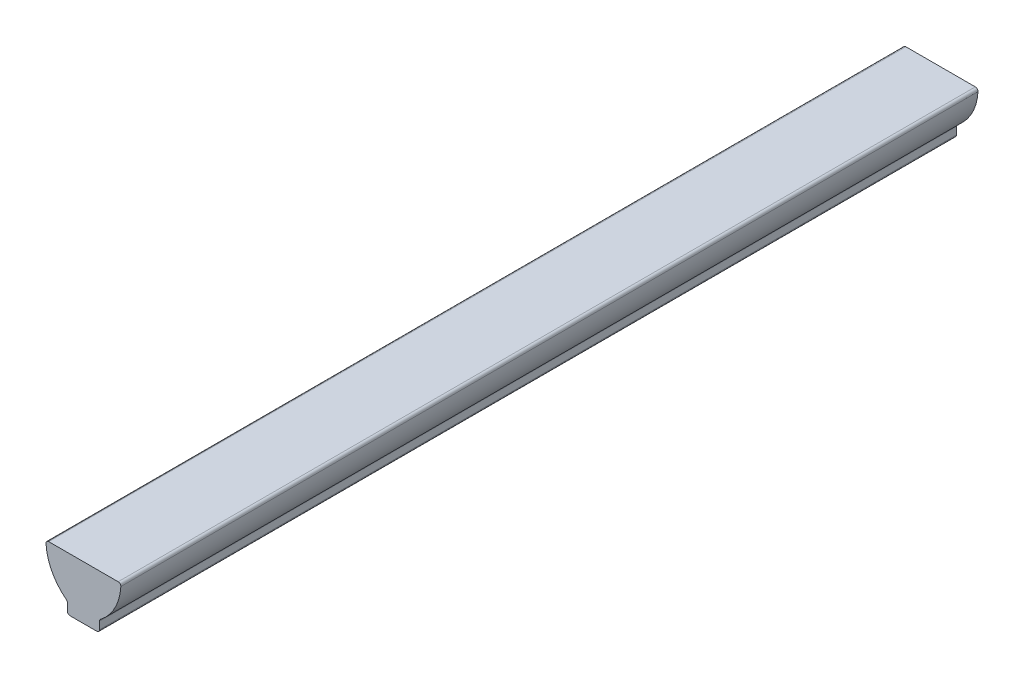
ISO-10303-21;
HEADER;
FILE_DESCRIPTION(('STEP AP214'),'2;1');
FILE_NAME('part.step','',(''),(''),'','','');
FILE_SCHEMA(('AUTOMOTIVE_DESIGN { 1 0 10303 214 1 1 1 1 }'));
ENDSEC;
DATA;
#1=APPLICATION_CONTEXT('core data for automotive mechanical design processes');
#2=APPLICATION_PROTOCOL_DEFINITION('international standard','automotive_design',2000,#1);
#3=PRODUCT_CONTEXT('',#1,'mechanical');
#4=PRODUCT('Part','Part','',(#3));
#5=PRODUCT_RELATED_PRODUCT_CATEGORY('part','',(#4));
#6=PRODUCT_DEFINITION_FORMATION('','',#4);
#7=PRODUCT_DEFINITION_CONTEXT('part definition',#1,'design');
#8=PRODUCT_DEFINITION('design','',#6,#7);
#9=PRODUCT_DEFINITION_SHAPE('','',#8);
#10=(LENGTH_UNIT() NAMED_UNIT(*) SI_UNIT(.MILLI.,.METRE.));
#11=(NAMED_UNIT(*) PLANE_ANGLE_UNIT() SI_UNIT($,.RADIAN.));
#12=(NAMED_UNIT(*) SI_UNIT($,.STERADIAN.) SOLID_ANGLE_UNIT());
#13=UNCERTAINTY_MEASURE_WITH_UNIT(LENGTH_MEASURE(1.E-05),#10,'distance_accuracy_value','');
#14=(GEOMETRIC_REPRESENTATION_CONTEXT(3) GLOBAL_UNCERTAINTY_ASSIGNED_CONTEXT((#13)) GLOBAL_UNIT_ASSIGNED_CONTEXT((#10,
#11,#12)) REPRESENTATION_CONTEXT('',''));
#15=CARTESIAN_POINT('',(0.,0.,0.));
#16=DIRECTION('',(0.,0.,1.));
#17=DIRECTION('',(1.,0.,0.));
#18=AXIS2_PLACEMENT_3D('',#15,#16,#17);
#19=CARTESIAN_POINT('',(-20.5944714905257,30.1625,508.));
#20=DIRECTION('',(0.,0.,-1.));
#21=DIRECTION('',(-1.,0.,0.));
#22=AXIS2_PLACEMENT_3D('',#19,#20,#21);
#23=CYLINDRICAL_SURFACE('',#22,1.5875);
#24=CARTESIAN_POINT('',(-20.5944714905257,30.1625,0.));
#25=DIRECTION('',(0.,0.,1.));
#26=DIRECTION('',(-1.,0.,0.));
#27=AXIS2_PLACEMENT_3D('',#24,#25,#26);
#28=CIRCLE('',#27,1.5875);
#29=CARTESIAN_POINT('',(-20.5944714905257,31.75,0.));
#30=VERTEX_POINT('',#29);
#31=CARTESIAN_POINT('',(-22.1796406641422,30.076506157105,0.));
#32=VERTEX_POINT('',#31);
#33=EDGE_CURVE('E106',#30,#32,#28,.T.);
#34=ORIENTED_EDGE('',*,*,#33,.T.);
#35=DIRECTION('',(0.,0.,-1.));
#36=VECTOR('',#35,1.);
#37=CARTESIAN_POINT('',(-22.1796406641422,30.076506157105,508.));
#38=LINE('',#37,#36);
#39=CARTESIAN_POINT('',(-22.1796406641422,30.076506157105,508.));
#40=VERTEX_POINT('',#39);
#41=EDGE_CURVE('E9',#40,#32,#38,.T.);
#42=ORIENTED_EDGE('',*,*,#41,.F.);
#43=CARTESIAN_POINT('',(-20.5944714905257,30.1625,508.));
#44=DIRECTION('',(0.,0.,1.));
#45=DIRECTION('',(-1.,0.,0.));
#46=AXIS2_PLACEMENT_3D('',#43,#44,#45);
#47=CIRCLE('',#46,1.5875);
#48=CARTESIAN_POINT('',(-20.5944714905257,31.75,508.));
#49=VERTEX_POINT('',#48);
#50=EDGE_CURVE('E141',#49,#40,#47,.T.);
#51=ORIENTED_EDGE('',*,*,#50,.F.);
#52=DIRECTION('',(0.,0.,-1.));
#53=VECTOR('',#52,1.);
#54=CARTESIAN_POINT('',(-20.5944714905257,31.75,508.));
#55=LINE('',#54,#53);
#56=EDGE_CURVE('E119',#49,#30,#55,.T.);
#57=ORIENTED_EDGE('',*,*,#56,.T.);
#58=EDGE_LOOP('',(#34,#42,#51,#57));
#59=FACE_BOUND('',#58,.T.);
#60=ADVANCED_FACE('F14',(#59),#23,.T.);
#61=CARTESIAN_POINT('',(8.66874060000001,31.75,508.));
#62=DIRECTION('',(0.,0.,-1.));
#63=DIRECTION('',(-1.,0.,0.));
#64=AXIS2_PLACEMENT_3D('',#61,#62,#63);
#65=CYLINDRICAL_SURFACE('',#64,30.8937406);
#66=CARTESIAN_POINT('',(8.66874060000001,31.75,0.));
#67=DIRECTION('',(0.,0.,1.));
#68=DIRECTION('',(1.,0.,0.));
#69=AXIS2_PLACEMENT_3D('',#66,#67,#68);
#70=CIRCLE('',#69,30.8937406);
#71=CARTESIAN_POINT('',(-10.1457044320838,7.24612548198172,0.));
#72=VERTEX_POINT('',#71);
#73=EDGE_CURVE('E102',#32,#72,#70,.T.);
#74=ORIENTED_EDGE('',*,*,#73,.T.);
#75=DIRECTION('',(0.,0.,-1.));
#76=VECTOR('',#75,1.);
#77=CARTESIAN_POINT('',(-10.1457044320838,7.24612548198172,508.));
#78=LINE('',#77,#76);
#79=CARTESIAN_POINT('',(-10.1457044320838,7.24612548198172,508.));
#80=VERTEX_POINT('',#79);
#81=EDGE_CURVE('E21',#80,#72,#78,.T.);
#82=ORIENTED_EDGE('',*,*,#81,.F.);
#83=CARTESIAN_POINT('',(8.66874060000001,31.75,508.));
#84=DIRECTION('',(0.,0.,1.));
#85=DIRECTION('',(1.,0.,0.));
#86=AXIS2_PLACEMENT_3D('',#83,#84,#85);
#87=CIRCLE('',#86,30.8937406);
#88=EDGE_CURVE('E115',#40,#80,#87,.T.);
#89=ORIENTED_EDGE('',*,*,#88,.F.);
#90=ORIENTED_EDGE('',*,*,#41,.T.);
#91=EDGE_LOOP('',(#74,#82,#89,#90));
#92=FACE_BOUND('',#91,.T.);
#93=ADVANCED_FACE('F114',(#92),#65,.T.);
#94=CARTESIAN_POINT('',(-11.1125,5.98697395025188,508.));
#95=DIRECTION('',(0.,0.,-1.));
#96=DIRECTION('',(-1.,0.,0.));
#97=AXIS2_PLACEMENT_3D('',#94,#95,#96);
#98=CYLINDRICAL_SURFACE('',#97,1.5875);
#99=CARTESIAN_POINT('',(-11.1125,5.98697395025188,0.));
#100=DIRECTION('',(0.,0.,-1.));
#101=DIRECTION('',(-1.,0.,0.));
#102=AXIS2_PLACEMENT_3D('',#99,#100,#101);
#103=CIRCLE('',#102,1.5875);
#104=CARTESIAN_POINT('',(-9.525,5.98697395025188,0.));
#105=VERTEX_POINT('',#104);
#106=EDGE_CURVE('E108',#72,#105,#103,.T.);
#107=ORIENTED_EDGE('',*,*,#106,.T.);
#108=DIRECTION('',(0.,0.,-1.));
#109=VECTOR('',#108,1.);
#110=CARTESIAN_POINT('',(-9.525,5.98697395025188,508.));
#111=LINE('',#110,#109);
#112=CARTESIAN_POINT('',(-9.525,5.98697395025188,508.));
#113=VERTEX_POINT('',#112);
#114=EDGE_CURVE('E187',#113,#105,#111,.T.);
#115=ORIENTED_EDGE('',*,*,#114,.F.);
#116=CARTESIAN_POINT('',(-11.1125,5.98697395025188,508.));
#117=DIRECTION('',(0.,0.,-1.));
#118=DIRECTION('',(-1.,0.,0.));
#119=AXIS2_PLACEMENT_3D('',#116,#117,#118);
#120=CIRCLE('',#119,1.5875);
#121=EDGE_CURVE('E144',#80,#113,#120,.T.);
#122=ORIENTED_EDGE('',*,*,#121,.F.);
#123=ORIENTED_EDGE('',*,*,#81,.T.);
#124=EDGE_LOOP('',(#107,#115,#122,#123));
#125=FACE_BOUND('',#124,.T.);
#126=ADVANCED_FACE('F191',(#125),#98,.F.);
#127=CARTESIAN_POINT('',(-9.525,1.5875,508.));
#128=DIRECTION('',(1.,0.,0.));
#129=DIRECTION('',(0.,0.,-1.));
#130=AXIS2_PLACEMENT_3D('',#127,#128,#129);
#131=PLANE('',#130);
#132=DIRECTION('',(0.,-1.,0.));
#133=VECTOR('',#132,1.);
#134=CARTESIAN_POINT('',(-9.525,1.5875,0.));
#135=LINE('',#134,#133);
#136=CARTESIAN_POINT('',(-9.525,1.5875,0.));
#137=VERTEX_POINT('',#136);
#138=EDGE_CURVE('E123',#105,#137,#135,.T.);
#139=ORIENTED_EDGE('',*,*,#138,.T.);
#140=DIRECTION('',(0.,0.,-1.));
#141=VECTOR('',#140,1.);
#142=CARTESIAN_POINT('',(-9.525,1.5875,508.));
#143=LINE('',#142,#141);
#144=CARTESIAN_POINT('',(-9.525,1.5875,508.));
#145=VERTEX_POINT('',#144);
#146=EDGE_CURVE('E184',#145,#137,#143,.T.);
#147=ORIENTED_EDGE('',*,*,#146,.F.);
#148=DIRECTION('',(0.,-1.,0.));
#149=VECTOR('',#148,1.);
#150=CARTESIAN_POINT('',(-9.525,1.5875,508.));
#151=LINE('',#150,#149);
#152=EDGE_CURVE('E146',#113,#145,#151,.T.);
#153=ORIENTED_EDGE('',*,*,#152,.F.);
#154=ORIENTED_EDGE('',*,*,#114,.T.);
#155=EDGE_LOOP('',(#139,#147,#153,#154));
#156=FACE_BOUND('',#155,.T.);
#157=ADVANCED_FACE('F199',(#156),#131,.F.);
#158=CARTESIAN_POINT('',(-7.9375,1.5875,508.));
#159=DIRECTION('',(0.,0.,-1.));
#160=DIRECTION('',(-1.,0.,0.));
#161=AXIS2_PLACEMENT_3D('',#158,#159,#160);
#162=CYLINDRICAL_SURFACE('',#161,1.5875);
#163=CARTESIAN_POINT('',(-7.9375,1.5875,0.));
#164=DIRECTION('',(0.,0.,1.));
#165=DIRECTION('',(1.,0.,0.));
#166=AXIS2_PLACEMENT_3D('',#163,#164,#165);
#167=CIRCLE('',#166,1.5875);
#168=CARTESIAN_POINT('',(-7.9375,0.,0.));
#169=VERTEX_POINT('',#168);
#170=EDGE_CURVE('E125',#137,#169,#167,.T.);
#171=ORIENTED_EDGE('',*,*,#170,.T.);
#172=DIRECTION('',(0.,0.,-1.));
#173=VECTOR('',#172,1.);
#174=CARTESIAN_POINT('',(-7.9375,0.,508.));
#175=LINE('',#174,#173);
#176=CARTESIAN_POINT('',(-7.9375,0.,508.));
#177=VERTEX_POINT('',#176);
#178=EDGE_CURVE('E181',#177,#169,#175,.T.);
#179=ORIENTED_EDGE('',*,*,#178,.F.);
#180=CARTESIAN_POINT('',(-7.9375,1.5875,508.));
#181=DIRECTION('',(0.,0.,1.));
#182=DIRECTION('',(1.,0.,0.));
#183=AXIS2_PLACEMENT_3D('',#180,#181,#182);
#184=CIRCLE('',#183,1.5875);
#185=EDGE_CURVE('E148',#145,#177,#184,.T.);
#186=ORIENTED_EDGE('',*,*,#185,.F.);
#187=ORIENTED_EDGE('',*,*,#146,.T.);
#188=EDGE_LOOP('',(#171,#179,#186,#187));
#189=FACE_BOUND('',#188,.T.);
#190=ADVANCED_FACE('F202',(#189),#162,.T.);
#191=CARTESIAN_POINT('',(-7.9375,0.,508.));
#192=DIRECTION('',(0.,1.,0.));
#193=DIRECTION('',(0.,0.,1.));
#194=AXIS2_PLACEMENT_3D('',#191,#192,#193);
#195=PLANE('',#194);
#196=DIRECTION('',(1.,0.,0.));
#197=VECTOR('',#196,1.);
#198=CARTESIAN_POINT('',(-7.9375,0.,0.));
#199=LINE('',#198,#197);
#200=CARTESIAN_POINT('',(7.9375,0.,0.));
#201=VERTEX_POINT('',#200);
#202=EDGE_CURVE('E127',#169,#201,#199,.T.);
#203=ORIENTED_EDGE('',*,*,#202,.T.);
#204=DIRECTION('',(0.,0.,-1.));
#205=VECTOR('',#204,1.);
#206=CARTESIAN_POINT('',(7.9375,0.,508.));
#207=LINE('',#206,#205);
#208=CARTESIAN_POINT('',(7.9375,0.,508.));
#209=VERTEX_POINT('',#208);
#210=EDGE_CURVE('E178',#209,#201,#207,.T.);
#211=ORIENTED_EDGE('',*,*,#210,.F.);
#212=DIRECTION('',(1.,0.,0.));
#213=VECTOR('',#212,1.);
#214=CARTESIAN_POINT('',(-7.9375,0.,508.));
#215=LINE('',#214,#213);
#216=EDGE_CURVE('E150',#177,#209,#215,.T.);
#217=ORIENTED_EDGE('',*,*,#216,.F.);
#218=ORIENTED_EDGE('',*,*,#178,.T.);
#219=EDGE_LOOP('',(#203,#211,#217,#218));
#220=FACE_BOUND('',#219,.T.);
#221=ADVANCED_FACE('F207',(#220),#195,.F.);
#222=CARTESIAN_POINT('',(7.9375,1.5875,508.));
#223=DIRECTION('',(0.,0.,-1.));
#224=DIRECTION('',(-1.,0.,0.));
#225=AXIS2_PLACEMENT_3D('',#222,#223,#224);
#226=CYLINDRICAL_SURFACE('',#225,1.5875);
#227=CARTESIAN_POINT('',(7.9375,1.5875,0.));
#228=DIRECTION('',(0.,0.,1.));
#229=DIRECTION('',(1.,0.,0.));
#230=AXIS2_PLACEMENT_3D('',#227,#228,#229);
#231=CIRCLE('',#230,1.5875);
#232=CARTESIAN_POINT('',(9.525,1.5875,0.));
#233=VERTEX_POINT('',#232);
#234=EDGE_CURVE('E129',#201,#233,#231,.T.);
#235=ORIENTED_EDGE('',*,*,#234,.T.);
#236=DIRECTION('',(0.,0.,-1.));
#237=VECTOR('',#236,1.);
#238=CARTESIAN_POINT('',(9.525,1.5875,508.));
#239=LINE('',#238,#237);
#240=CARTESIAN_POINT('',(9.525,1.5875,508.));
#241=VERTEX_POINT('',#240);
#242=EDGE_CURVE('E175',#241,#233,#239,.T.);
#243=ORIENTED_EDGE('',*,*,#242,.F.);
#244=CARTESIAN_POINT('',(7.9375,1.5875,508.));
#245=DIRECTION('',(0.,0.,1.));
#246=DIRECTION('',(1.,0.,0.));
#247=AXIS2_PLACEMENT_3D('',#244,#245,#246);
#248=CIRCLE('',#247,1.5875);
#249=EDGE_CURVE('E152',#209,#241,#248,.T.);
#250=ORIENTED_EDGE('',*,*,#249,.F.);
#251=ORIENTED_EDGE('',*,*,#210,.T.);
#252=EDGE_LOOP('',(#235,#243,#250,#251));
#253=FACE_BOUND('',#252,.T.);
#254=ADVANCED_FACE('F213',(#253),#226,.T.);
#255=CARTESIAN_POINT('',(9.525,1.5875,508.));
#256=DIRECTION('',(-1.,0.,0.));
#257=DIRECTION('',(0.,0.,1.));
#258=AXIS2_PLACEMENT_3D('',#255,#256,#257);
#259=PLANE('',#258);
#260=DIRECTION('',(0.,1.,0.));
#261=VECTOR('',#260,1.);
#262=CARTESIAN_POINT('',(9.525,1.5875,0.));
#263=LINE('',#262,#261);
#264=CARTESIAN_POINT('',(9.525,5.98697395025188,0.));
#265=VERTEX_POINT('',#264);
#266=EDGE_CURVE('E131',#233,#265,#263,.T.);
#267=ORIENTED_EDGE('',*,*,#266,.T.);
#268=DIRECTION('',(0.,0.,-1.));
#269=VECTOR('',#268,1.);
#270=CARTESIAN_POINT('',(9.525,5.98697395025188,508.));
#271=LINE('',#270,#269);
#272=CARTESIAN_POINT('',(9.525,5.98697395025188,508.));
#273=VERTEX_POINT('',#272);
#274=EDGE_CURVE('E172',#273,#265,#271,.T.);
#275=ORIENTED_EDGE('',*,*,#274,.F.);
#276=DIRECTION('',(0.,1.,0.));
#277=VECTOR('',#276,1.);
#278=CARTESIAN_POINT('',(9.525,1.5875,508.));
#279=LINE('',#278,#277);
#280=EDGE_CURVE('E154',#241,#273,#279,.T.);
#281=ORIENTED_EDGE('',*,*,#280,.F.);
#282=ORIENTED_EDGE('',*,*,#242,.T.);
#283=EDGE_LOOP('',(#267,#275,#281,#282));
#284=FACE_BOUND('',#283,.T.);
#285=ADVANCED_FACE('F217',(#284),#259,.F.);
#286=CARTESIAN_POINT('',(11.1125,5.98697395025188,508.));
#287=DIRECTION('',(0.,0.,-1.));
#288=DIRECTION('',(-1.,0.,0.));
#289=AXIS2_PLACEMENT_3D('',#286,#287,#288);
#290=CYLINDRICAL_SURFACE('',#289,1.5875);
#291=CARTESIAN_POINT('',(11.1125,5.98697395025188,0.));
#292=DIRECTION('',(0.,0.,-1.));
#293=DIRECTION('',(-1.,0.,0.));
#294=AXIS2_PLACEMENT_3D('',#291,#292,#293);
#295=CIRCLE('',#294,1.5875);
#296=CARTESIAN_POINT('',(10.1457044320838,7.24612548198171,0.));
#297=VERTEX_POINT('',#296);
#298=EDGE_CURVE('E133',#265,#297,#295,.T.);
#299=ORIENTED_EDGE('',*,*,#298,.T.);
#300=DIRECTION('',(0.,0.,-1.));
#301=VECTOR('',#300,1.);
#302=CARTESIAN_POINT('',(10.1457044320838,7.24612548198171,508.));
#303=LINE('',#302,#301);
#304=CARTESIAN_POINT('',(10.1457044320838,7.24612548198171,508.));
#305=VERTEX_POINT('',#304);
#306=EDGE_CURVE('E169',#305,#297,#303,.T.);
#307=ORIENTED_EDGE('',*,*,#306,.F.);
#308=CARTESIAN_POINT('',(11.1125,5.98697395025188,508.));
#309=DIRECTION('',(0.,0.,-1.));
#310=DIRECTION('',(-1.,0.,0.));
#311=AXIS2_PLACEMENT_3D('',#308,#309,#310);
#312=CIRCLE('',#311,1.5875);
#313=EDGE_CURVE('E156',#273,#305,#312,.T.);
#314=ORIENTED_EDGE('',*,*,#313,.F.);
#315=ORIENTED_EDGE('',*,*,#274,.T.);
#316=EDGE_LOOP('',(#299,#307,#314,#315));
#317=FACE_BOUND('',#316,.T.);
#318=ADVANCED_FACE('F222',(#317),#290,.F.);
#319=CARTESIAN_POINT('',(-8.66874060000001,31.75,508.));
#320=DIRECTION('',(0.,0.,-1.));
#321=DIRECTION('',(-1.,0.,0.));
#322=AXIS2_PLACEMENT_3D('',#319,#320,#321);
#323=CYLINDRICAL_SURFACE('',#322,30.8937406);
#324=CARTESIAN_POINT('',(-8.66874060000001,31.75,0.));
#325=DIRECTION('',(0.,0.,1.));
#326=DIRECTION('',(-1.,0.,0.));
#327=AXIS2_PLACEMENT_3D('',#324,#325,#326);
#328=CIRCLE('',#327,30.8937406);
#329=CARTESIAN_POINT('',(22.1796406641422,30.076506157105,0.));
#330=VERTEX_POINT('',#329);
#331=EDGE_CURVE('E135',#297,#330,#328,.T.);
#332=ORIENTED_EDGE('',*,*,#331,.T.);
#333=DIRECTION('',(0.,0.,-1.));
#334=VECTOR('',#333,1.);
#335=CARTESIAN_POINT('',(22.1796406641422,30.076506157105,508.));
#336=LINE('',#335,#334);
#337=CARTESIAN_POINT('',(22.1796406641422,30.076506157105,508.));
#338=VERTEX_POINT('',#337);
#339=EDGE_CURVE('E166',#338,#330,#336,.T.);
#340=ORIENTED_EDGE('',*,*,#339,.F.);
#341=CARTESIAN_POINT('',(-8.66874060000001,31.75,508.));
#342=DIRECTION('',(0.,0.,1.));
#343=DIRECTION('',(-1.,0.,0.));
#344=AXIS2_PLACEMENT_3D('',#341,#342,#343);
#345=CIRCLE('',#344,30.8937406);
#346=EDGE_CURVE('E158',#305,#338,#345,.T.);
#347=ORIENTED_EDGE('',*,*,#346,.F.);
#348=ORIENTED_EDGE('',*,*,#306,.T.);
#349=EDGE_LOOP('',(#332,#340,#347,#348));
#350=FACE_BOUND('',#349,.T.);
#351=ADVANCED_FACE('F226',(#350),#323,.T.);
#352=CARTESIAN_POINT('',(20.5944714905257,30.1625,508.));
#353=DIRECTION('',(0.,0.,-1.));
#354=DIRECTION('',(-1.,0.,0.));
#355=AXIS2_PLACEMENT_3D('',#352,#353,#354);
#356=CYLINDRICAL_SURFACE('',#355,1.5875);
#357=CARTESIAN_POINT('',(20.5944714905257,30.1625,0.));
#358=DIRECTION('',(0.,0.,1.));
#359=DIRECTION('',(-1.,0.,0.));
#360=AXIS2_PLACEMENT_3D('',#357,#358,#359);
#361=CIRCLE('',#360,1.5875);
#362=CARTESIAN_POINT('',(20.5944714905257,31.75,0.));
#363=VERTEX_POINT('',#362);
#364=EDGE_CURVE('E137',#330,#363,#361,.T.);
#365=ORIENTED_EDGE('',*,*,#364,.T.);
#366=DIRECTION('',(0.,0.,-1.));
#367=VECTOR('',#366,1.);
#368=CARTESIAN_POINT('',(20.5944714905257,31.75,508.));
#369=LINE('',#368,#367);
#370=CARTESIAN_POINT('',(20.5944714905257,31.75,508.));
#371=VERTEX_POINT('',#370);
#372=EDGE_CURVE('E163',#371,#363,#369,.T.);
#373=ORIENTED_EDGE('',*,*,#372,.F.);
#374=CARTESIAN_POINT('',(20.5944714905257,30.1625,508.));
#375=DIRECTION('',(0.,0.,1.));
#376=DIRECTION('',(-1.,0.,0.));
#377=AXIS2_PLACEMENT_3D('',#374,#375,#376);
#378=CIRCLE('',#377,1.5875);
#379=EDGE_CURVE('E33',#338,#371,#378,.T.);
#380=ORIENTED_EDGE('',*,*,#379,.F.);
#381=ORIENTED_EDGE('',*,*,#339,.T.);
#382=EDGE_LOOP('',(#365,#373,#380,#381));
#383=FACE_BOUND('',#382,.T.);
#384=ADVANCED_FACE('F230',(#383),#356,.T.);
#385=CARTESIAN_POINT('',(-20.5944714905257,31.75,508.));
#386=DIRECTION('',(0.,-1.,0.));
#387=DIRECTION('',(0.,0.,-1.));
#388=AXIS2_PLACEMENT_3D('',#385,#386,#387);
#389=PLANE('',#388);
#390=DIRECTION('',(-1.,0.,0.));
#391=VECTOR('',#390,1.);
#392=CARTESIAN_POINT('',(-20.5944714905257,31.75,0.));
#393=LINE('',#392,#391);
#394=EDGE_CURVE('E139',#363,#30,#393,.T.);
#395=ORIENTED_EDGE('',*,*,#394,.T.);
#396=ORIENTED_EDGE('',*,*,#56,.F.);
#397=DIRECTION('',(-1.,0.,0.));
#398=VECTOR('',#397,1.);
#399=CARTESIAN_POINT('',(-20.5944714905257,31.75,508.));
#400=LINE('',#399,#398);
#401=EDGE_CURVE('E28',#371,#49,#400,.T.);
#402=ORIENTED_EDGE('',*,*,#401,.F.);
#403=ORIENTED_EDGE('',*,*,#372,.T.);
#404=EDGE_LOOP('',(#395,#396,#402,#403));
#405=FACE_BOUND('',#404,.T.);
#406=ADVANCED_FACE('F232',(#405),#389,.F.);
#407=CARTESIAN_POINT('',(-20.5944714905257,30.1625,508.));
#408=DIRECTION('',(0.,0.,-1.));
#409=DIRECTION('',(-1.,0.,0.));
#410=AXIS2_PLACEMENT_3D('',#407,#408,#409);
#411=PLANE('',#410);
#412=ORIENTED_EDGE('',*,*,#50,.T.);
#413=ORIENTED_EDGE('',*,*,#88,.T.);
#414=ORIENTED_EDGE('',*,*,#121,.T.);
#415=ORIENTED_EDGE('',*,*,#152,.T.);
#416=ORIENTED_EDGE('',*,*,#185,.T.);
#417=ORIENTED_EDGE('',*,*,#216,.T.);
#418=ORIENTED_EDGE('',*,*,#249,.T.);
#419=ORIENTED_EDGE('',*,*,#280,.T.);
#420=ORIENTED_EDGE('',*,*,#313,.T.);
#421=ORIENTED_EDGE('',*,*,#346,.T.);
#422=ORIENTED_EDGE('',*,*,#379,.T.);
#423=ORIENTED_EDGE('',*,*,#401,.T.);
#424=EDGE_LOOP('',(#412,#413,#414,#415,#416,#417,#418,#419,#420,#421,#422,#423));
#425=FACE_BOUND('',#424,.T.);
#426=ADVANCED_FACE('F194',(#425),#411,.F.);
#427=CARTESIAN_POINT('',(-20.5944714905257,30.1625,0.));
#428=DIRECTION('',(0.,0.,-1.));
#429=DIRECTION('',(-1.,0.,0.));
#430=AXIS2_PLACEMENT_3D('',#427,#428,#429);
#431=PLANE('',#430);
#432=ORIENTED_EDGE('',*,*,#33,.F.);
#433=ORIENTED_EDGE('',*,*,#394,.F.);
#434=ORIENTED_EDGE('',*,*,#364,.F.);
#435=ORIENTED_EDGE('',*,*,#331,.F.);
#436=ORIENTED_EDGE('',*,*,#298,.F.);
#437=ORIENTED_EDGE('',*,*,#266,.F.);
#438=ORIENTED_EDGE('',*,*,#234,.F.);
#439=ORIENTED_EDGE('',*,*,#202,.F.);
#440=ORIENTED_EDGE('',*,*,#170,.F.);
#441=ORIENTED_EDGE('',*,*,#138,.F.);
#442=ORIENTED_EDGE('',*,*,#106,.F.);
#443=ORIENTED_EDGE('',*,*,#73,.F.);
#444=EDGE_LOOP('',(#432,#433,#434,#435,#436,#437,#438,#439,#440,#441,#442,#443));
#445=FACE_BOUND('',#444,.T.);
#446=ADVANCED_FACE('F103',(#445),#431,.T.);
#447=CLOSED_SHELL('',(#60,#93,#126,#157,#190,#221,#254,#285,#318,#351,#384,#406,#426,#446));
#448=MANIFOLD_SOLID_BREP('B1',#447);
#449=ADVANCED_BREP_SHAPE_REPRESENTATION('',(#18,#448),#14);
#450=SHAPE_DEFINITION_REPRESENTATION(#9,#449);
ENDSEC;
END-ISO-10303-21;
